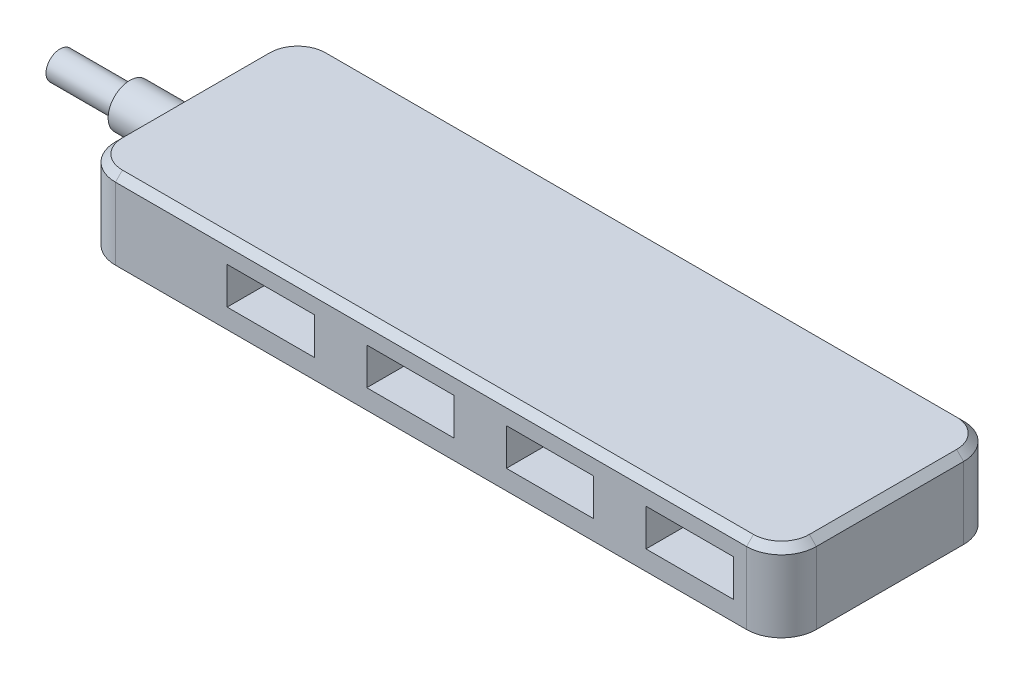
from build123d import *

# Parameters (mm, degrees)
CROQUIS1_W              = 100.4
CROQUIS1_H              = 31.1
SALIENTE_EXTRUIR1_DEPTH = 11.3
REDONDEO1_R             = 5
CHAFL_N1_SIZE           = 1
CROQUIS2_W              = 12.5
CROQUIS2_H              = 5.3
CORTAR_EXTRUIR1_DEPTH   = 13
CROQUIS3_R              = 3.1
SALIENTE_EXTRUIR2_DEPTH = 8.5
CROQUIS4_R              = 2
SALIENTE_EXTRUIR3_DEPTH = 10


with BuildPart() as part:
    # Croquis1 → Saliente-Extruir1 (new body)
    with BuildSketch(Plane(origin=(0, 0, 0), x_dir=(1, 0, 0), z_dir=(0, 1, 0))):
        Rectangle(CROQUIS1_W, CROQUIS1_H)
    extrude(amount=SALIENTE_EXTRUIR1_DEPTH)

    # Redondeo1
    redondeo1_edges = [part.edges().sort_by_distance(p)[0] for p in [
        (50.2, 5.65, 15.55),
        (-50.2, 5.65, 15.55),
        (-50.2, 5.65, -15.55),
        (50.2, 5.65, -15.55),
    ]]
    fillet(redondeo1_edges, radius=REDONDEO1_R)

    # Chafl_n1
    chafl_n1_edges = [part.edges().sort_by_distance(p)[0] for p in [
        (0, 11.3, 15.55),
        (-50.2, 11.3, 0),
        (50.2, 11.3, 0),
        (0, 11.3, -15.55),
        (48.735533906, 11.3, 14.085533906),
        (48.735533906, 11.3, -14.085533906),
        (-48.735533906, 11.3, -14.085533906),
        (-48.735533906, 11.3, 14.085533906),
    ]]
    chamfer(chafl_n1_edges, length=CHAFL_N1_SIZE)

    # Croquis2 → Cortar-Extruir1 (cut)
    with BuildSketch(Plane.XY.offset(15.55)):
        with Locations((-22.95, 5.45)):
            Rectangle(CROQUIS2_W, CROQUIS2_H)
        with Locations((-2.95, 5.45)):
            Rectangle(CROQUIS2_W, CROQUIS2_H)
        with Locations((17.05, 5.45)):
            Rectangle(CROQUIS2_W, CROQUIS2_H)
        with Locations((37.05, 5.45)):
            Rectangle(CROQUIS2_W, CROQUIS2_H)
    extrude(amount=-CORTAR_EXTRUIR1_DEPTH, mode=Mode.SUBTRACT)

    # Croquis3 → Saliente-Extruir2 (add)
    with BuildSketch(Plane.ZY.offset(50.2)):
        with Locations(Location((0, 5.3, 0), (0, 0, 180))):
            Circle(CROQUIS3_R)
    extrude(amount=SALIENTE_EXTRUIR2_DEPTH)

    # Croquis4 → Saliente-Extruir3 (add)
    with BuildSketch(Plane.ZY.offset(58.7)):
        with Locations((0, 5.3)):
            Circle(CROQUIS4_R)
    extrude(amount=SALIENTE_EXTRUIR3_DEPTH)


solid = part.part
